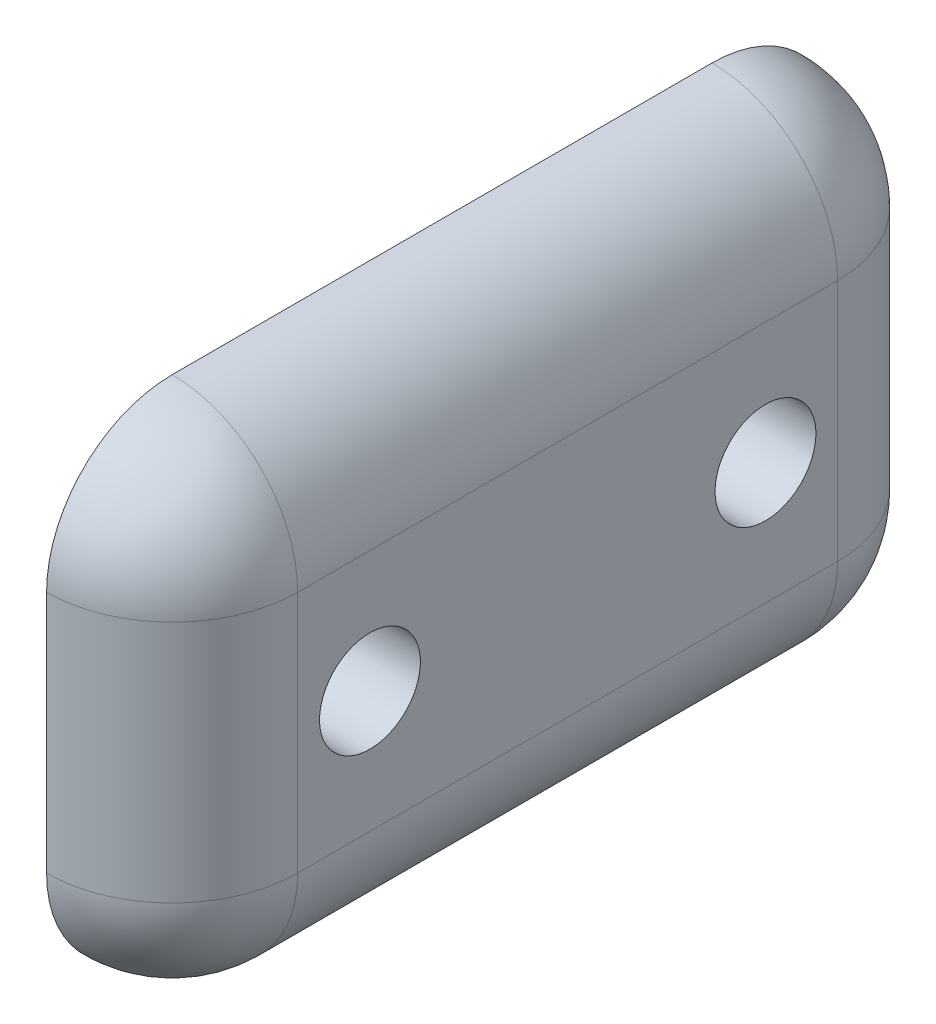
ISO-10303-21;
HEADER;
FILE_DESCRIPTION(('STEP AP214'),'2;1');
FILE_NAME('part.step','',(''),(''),'','','');
FILE_SCHEMA(('AUTOMOTIVE_DESIGN { 1 0 10303 214 1 1 1 1 }'));
ENDSEC;
DATA;
#1=APPLICATION_CONTEXT('core data for automotive mechanical design processes');
#2=APPLICATION_PROTOCOL_DEFINITION('international standard','automotive_design',2000,#1);
#3=PRODUCT_CONTEXT('',#1,'mechanical');
#4=PRODUCT('Part','Part','',(#3));
#5=PRODUCT_RELATED_PRODUCT_CATEGORY('part','',(#4));
#6=PRODUCT_DEFINITION_FORMATION('','',#4);
#7=PRODUCT_DEFINITION_CONTEXT('part definition',#1,'design');
#8=PRODUCT_DEFINITION('design','',#6,#7);
#9=PRODUCT_DEFINITION_SHAPE('','',#8);
#10=(LENGTH_UNIT() NAMED_UNIT(*) SI_UNIT(.MILLI.,.METRE.));
#11=(NAMED_UNIT(*) PLANE_ANGLE_UNIT() SI_UNIT($,.RADIAN.));
#12=(NAMED_UNIT(*) SI_UNIT($,.STERADIAN.) SOLID_ANGLE_UNIT());
#13=UNCERTAINTY_MEASURE_WITH_UNIT(LENGTH_MEASURE(1.E-05),#10,'distance_accuracy_value','');
#14=(GEOMETRIC_REPRESENTATION_CONTEXT(3) GLOBAL_UNCERTAINTY_ASSIGNED_CONTEXT((#13)) GLOBAL_UNIT_ASSIGNED_CONTEXT((#10,
#11,#12)) REPRESENTATION_CONTEXT('',''));
#15=CARTESIAN_POINT('',(0.,0.,0.));
#16=DIRECTION('',(0.,0.,1.));
#17=DIRECTION('',(1.,0.,0.));
#18=AXIS2_PLACEMENT_3D('',#15,#16,#17);
#19=CARTESIAN_POINT('',(3.175,-12.5,20.));
#20=DIRECTION('',(1.,0.,0.));
#21=DIRECTION('',(0.,0.,-1.));
#22=AXIS2_PLACEMENT_3D('',#19,#20,#21);
#23=PLANE('',#22);
#24=CARTESIAN_POINT('',(3.175,0.,10.));
#25=DIRECTION('',(-1.,0.,0.));
#26=DIRECTION('',(0.,0.,1.));
#27=AXIS2_PLACEMENT_3D('',#24,#25,#26);
#28=CIRCLE('',#27,2.55);
#29=CARTESIAN_POINT('',(3.175,0.,12.55));
#30=VERTEX_POINT('',#29);
#31=EDGE_CURVE('E149',#30,#30,#28,.T.);
#32=ORIENTED_EDGE('',*,*,#31,.T.);
#33=EDGE_LOOP('',(#32));
#34=FACE_BOUND('',#33,.T.);
#35=CARTESIAN_POINT('',(3.175,0.,-10.));
#36=DIRECTION('',(-1.,0.,0.));
#37=DIRECTION('',(0.,0.,1.));
#38=AXIS2_PLACEMENT_3D('',#35,#36,#37);
#39=CIRCLE('',#38,2.55);
#40=CARTESIAN_POINT('',(3.175,0.,-7.45));
#41=VERTEX_POINT('',#40);
#42=EDGE_CURVE('E108',#41,#41,#39,.T.);
#43=ORIENTED_EDGE('',*,*,#42,.T.);
#44=EDGE_LOOP('',(#43));
#45=FACE_BOUND('',#44,.T.);
#46=DIRECTION('',(0.,1.,0.));
#47=VECTOR('',#46,1.);
#48=CARTESIAN_POINT('',(3.175,12.5,-13.65));
#49=LINE('',#48,#47);
#50=CARTESIAN_POINT('',(3.175,-6.15,-13.65));
#51=VERTEX_POINT('',#50);
#52=CARTESIAN_POINT('',(3.175,6.15,-13.65));
#53=VERTEX_POINT('',#52);
#54=EDGE_CURVE('E45',#51,#53,#49,.T.);
#55=ORIENTED_EDGE('',*,*,#54,.T.);
#56=DIRECTION('',(0.,0.,1.));
#57=VECTOR('',#56,1.);
#58=CARTESIAN_POINT('',(3.175,6.15,20.));
#59=LINE('',#58,#57);
#60=CARTESIAN_POINT('',(3.175,6.15,13.65));
#61=VERTEX_POINT('',#60);
#62=EDGE_CURVE('E11',#53,#61,#59,.T.);
#63=ORIENTED_EDGE('',*,*,#62,.T.);
#64=DIRECTION('',(0.,-1.,0.));
#65=VECTOR('',#64,1.);
#66=CARTESIAN_POINT('',(3.175,-12.5,13.65));
#67=LINE('',#66,#65);
#68=CARTESIAN_POINT('',(3.175,-6.15,13.65));
#69=VERTEX_POINT('',#68);
#70=EDGE_CURVE('E104',#61,#69,#67,.T.);
#71=ORIENTED_EDGE('',*,*,#70,.T.);
#72=DIRECTION('',(0.,0.,-1.));
#73=VECTOR('',#72,1.);
#74=CARTESIAN_POINT('',(3.175,-6.15,-20.));
#75=LINE('',#74,#73);
#76=EDGE_CURVE('E55',#69,#51,#75,.T.);
#77=ORIENTED_EDGE('',*,*,#76,.T.);
#78=EDGE_LOOP('',(#55,#63,#71,#77));
#79=FACE_BOUND('',#78,.T.);
#80=ADVANCED_FACE('F38',(#34,#45,#79),#23,.T.);
#81=CARTESIAN_POINT('',(-3.175,-12.5,20.));
#82=DIRECTION('',(1.,0.,0.));
#83=DIRECTION('',(0.,0.,-1.));
#84=AXIS2_PLACEMENT_3D('',#81,#82,#83);
#85=PLANE('',#84);
#86=CARTESIAN_POINT('',(-3.175,0.,10.));
#87=DIRECTION('',(-1.,0.,0.));
#88=DIRECTION('',(0.,0.,1.));
#89=AXIS2_PLACEMENT_3D('',#86,#87,#88);
#90=CIRCLE('',#89,2.54999999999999);
#91=CARTESIAN_POINT('',(-3.175,0.,12.55));
#92=VERTEX_POINT('',#91);
#93=EDGE_CURVE('E152',#92,#92,#90,.T.);
#94=ORIENTED_EDGE('',*,*,#93,.F.);
#95=EDGE_LOOP('',(#94));
#96=FACE_BOUND('',#95,.T.);
#97=CARTESIAN_POINT('',(-3.175,0.,-10.));
#98=DIRECTION('',(-1.,0.,0.));
#99=DIRECTION('',(0.,0.,1.));
#100=AXIS2_PLACEMENT_3D('',#97,#98,#99);
#101=CIRCLE('',#100,2.54999999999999);
#102=CARTESIAN_POINT('',(-3.175,0.,-7.45000000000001));
#103=VERTEX_POINT('',#102);
#104=EDGE_CURVE('E146',#103,#103,#101,.T.);
#105=ORIENTED_EDGE('',*,*,#104,.F.);
#106=EDGE_LOOP('',(#105));
#107=FACE_BOUND('',#106,.T.);
#108=DIRECTION('',(0.,-1.,0.));
#109=VECTOR('',#108,1.);
#110=CARTESIAN_POINT('',(-3.175,12.5,20.));
#111=LINE('',#110,#109);
#112=CARTESIAN_POINT('',(-3.175,6.15,20.));
#113=VERTEX_POINT('',#112);
#114=CARTESIAN_POINT('',(-3.175,-6.15,20.));
#115=VERTEX_POINT('',#114);
#116=EDGE_CURVE('E88',#113,#115,#111,.T.);
#117=ORIENTED_EDGE('',*,*,#116,.F.);
#118=CARTESIAN_POINT('',(-3.175,6.15,13.65));
#119=DIRECTION('',(1.,0.,0.));
#120=DIRECTION('',(0.,0.,-1.));
#121=AXIS2_PLACEMENT_3D('',#118,#119,#120);
#122=CIRCLE('',#121,6.35);
#123=CARTESIAN_POINT('',(-3.175,12.5,13.65));
#124=VERTEX_POINT('',#123);
#125=EDGE_CURVE('E92',#113,#124,#122,.F.);
#126=ORIENTED_EDGE('',*,*,#125,.T.);
#127=DIRECTION('',(0.,0.,1.));
#128=VECTOR('',#127,1.);
#129=CARTESIAN_POINT('',(-3.175,12.5,20.));
#130=LINE('',#129,#128);
#131=CARTESIAN_POINT('',(-3.175,12.5,-13.65));
#132=VERTEX_POINT('',#131);
#133=EDGE_CURVE('E121',#132,#124,#130,.T.);
#134=ORIENTED_EDGE('',*,*,#133,.F.);
#135=CARTESIAN_POINT('',(-3.175,6.15,-13.65));
#136=DIRECTION('',(1.,0.,0.));
#137=DIRECTION('',(0.,0.,-1.));
#138=AXIS2_PLACEMENT_3D('',#135,#136,#137);
#139=CIRCLE('',#138,6.35);
#140=CARTESIAN_POINT('',(-3.175,6.15,-20.));
#141=VERTEX_POINT('',#140);
#142=EDGE_CURVE('E112',#132,#141,#139,.F.);
#143=ORIENTED_EDGE('',*,*,#142,.T.);
#144=DIRECTION('',(0.,1.,0.));
#145=VECTOR('',#144,1.);
#146=CARTESIAN_POINT('',(-3.175,12.5,-20.));
#147=LINE('',#146,#145);
#148=CARTESIAN_POINT('',(-3.175,-6.14999999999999,-20.));
#149=VERTEX_POINT('',#148);
#150=EDGE_CURVE('E123',#149,#141,#147,.T.);
#151=ORIENTED_EDGE('',*,*,#150,.F.);
#152=CARTESIAN_POINT('',(-3.175,-6.15,-13.65));
#153=DIRECTION('',(1.,0.,0.));
#154=DIRECTION('',(0.,0.,-1.));
#155=AXIS2_PLACEMENT_3D('',#152,#153,#154);
#156=CIRCLE('',#155,6.35);
#157=CARTESIAN_POINT('',(-3.175,-12.5,-13.65));
#158=VERTEX_POINT('',#157);
#159=EDGE_CURVE('E115',#149,#158,#156,.F.);
#160=ORIENTED_EDGE('',*,*,#159,.T.);
#161=DIRECTION('',(0.,0.,-1.));
#162=VECTOR('',#161,1.);
#163=CARTESIAN_POINT('',(-3.175,-12.5,20.));
#164=LINE('',#163,#162);
#165=CARTESIAN_POINT('',(-3.175,-12.5,13.65));
#166=VERTEX_POINT('',#165);
#167=EDGE_CURVE('E98',#166,#158,#164,.T.);
#168=ORIENTED_EDGE('',*,*,#167,.F.);
#169=CARTESIAN_POINT('',(-3.175,-6.15,13.65));
#170=DIRECTION('',(1.,0.,0.));
#171=DIRECTION('',(0.,0.,-1.));
#172=AXIS2_PLACEMENT_3D('',#169,#170,#171);
#173=CIRCLE('',#172,6.35);
#174=EDGE_CURVE('E94',#166,#115,#173,.F.);
#175=ORIENTED_EDGE('',*,*,#174,.T.);
#176=EDGE_LOOP('',(#117,#126,#134,#143,#151,#160,#168,#175));
#177=FACE_BOUND('',#176,.T.);
#178=ADVANCED_FACE('F90',(#96,#107,#177),#85,.F.);
#179=CARTESIAN_POINT('',(-3.175,-6.15,-13.65));
#180=DIRECTION('',(0.,0.,1.));
#181=DIRECTION('',(1.,0.,0.));
#182=AXIS2_PLACEMENT_3D('',#179,#180,#181);
#183=SPHERICAL_SURFACE('',#182,6.35);
#184=CARTESIAN_POINT('',(-3.175,-6.15,-13.65));
#185=DIRECTION('',(0.,0.,-1.));
#186=DIRECTION('',(0.,1.,0.));
#187=AXIS2_PLACEMENT_3D('',#184,#185,#186);
#188=CIRCLE('',#187,6.35);
#189=EDGE_CURVE('E130',#158,#51,#188,.F.);
#190=ORIENTED_EDGE('',*,*,#189,.F.);
#191=ORIENTED_EDGE('',*,*,#159,.F.);
#192=CARTESIAN_POINT('',(-3.175,-6.15,-13.65));
#193=DIRECTION('',(0.,-1.,0.));
#194=DIRECTION('',(1.,0.,0.));
#195=AXIS2_PLACEMENT_3D('',#192,#193,#194);
#196=CIRCLE('',#195,6.35);
#197=EDGE_CURVE('E99',#51,#149,#196,.F.);
#198=ORIENTED_EDGE('',*,*,#197,.F.);
#199=EDGE_LOOP('',(#190,#191,#198));
#200=FACE_BOUND('',#199,.T.);
#201=ADVANCED_FACE('F160',(#200),#183,.T.);
#202=CARTESIAN_POINT('',(-3.175,-12.5,-13.65));
#203=DIRECTION('',(0.,-1.,0.));
#204=DIRECTION('',(0.,0.,-1.));
#205=AXIS2_PLACEMENT_3D('',#202,#203,#204);
#206=CYLINDRICAL_SURFACE('',#205,6.35);
#207=ORIENTED_EDGE('',*,*,#197,.T.);
#208=ORIENTED_EDGE('',*,*,#150,.T.);
#209=CARTESIAN_POINT('',(-3.175,6.15,-13.65));
#210=DIRECTION('',(0.,1.,0.));
#211=DIRECTION('',(0.,0.,1.));
#212=AXIS2_PLACEMENT_3D('',#209,#210,#211);
#213=CIRCLE('',#212,6.35);
#214=EDGE_CURVE('E132',#53,#141,#213,.T.);
#215=ORIENTED_EDGE('',*,*,#214,.F.);
#216=ORIENTED_EDGE('',*,*,#54,.F.);
#217=EDGE_LOOP('',(#207,#208,#215,#216));
#218=FACE_BOUND('',#217,.T.);
#219=ADVANCED_FACE('F192',(#218),#206,.T.);
#220=CARTESIAN_POINT('',(-3.175,-6.15,20.));
#221=DIRECTION('',(0.,0.,1.));
#222=DIRECTION('',(0.,-1.,0.));
#223=AXIS2_PLACEMENT_3D('',#220,#221,#222);
#224=CYLINDRICAL_SURFACE('',#223,6.35);
#225=ORIENTED_EDGE('',*,*,#189,.T.);
#226=ORIENTED_EDGE('',*,*,#76,.F.);
#227=CARTESIAN_POINT('',(-3.175,-6.15,13.65));
#228=DIRECTION('',(0.,0.,1.));
#229=DIRECTION('',(1.,0.,0.));
#230=AXIS2_PLACEMENT_3D('',#227,#228,#229);
#231=CIRCLE('',#230,6.35);
#232=EDGE_CURVE('E135',#166,#69,#231,.T.);
#233=ORIENTED_EDGE('',*,*,#232,.F.);
#234=ORIENTED_EDGE('',*,*,#167,.T.);
#235=EDGE_LOOP('',(#225,#226,#233,#234));
#236=FACE_BOUND('',#235,.T.);
#237=ADVANCED_FACE('F200',(#236),#224,.T.);
#238=CARTESIAN_POINT('',(-3.175,6.15,-13.65));
#239=DIRECTION('',(0.,0.,1.));
#240=DIRECTION('',(1.,0.,0.));
#241=AXIS2_PLACEMENT_3D('',#238,#239,#240);
#242=SPHERICAL_SURFACE('',#241,6.35);
#243=ORIENTED_EDGE('',*,*,#214,.T.);
#244=ORIENTED_EDGE('',*,*,#142,.F.);
#245=CARTESIAN_POINT('',(-3.175,6.15,-13.65));
#246=DIRECTION('',(0.,0.,-1.));
#247=DIRECTION('',(-1.,0.,0.));
#248=AXIS2_PLACEMENT_3D('',#245,#246,#247);
#249=CIRCLE('',#248,6.35);
#250=EDGE_CURVE('E138',#53,#132,#249,.F.);
#251=ORIENTED_EDGE('',*,*,#250,.F.);
#252=EDGE_LOOP('',(#243,#244,#251));
#253=FACE_BOUND('',#252,.T.);
#254=ADVANCED_FACE('F208',(#253),#242,.T.);
#255=CARTESIAN_POINT('',(-3.175,-6.15,13.65));
#256=DIRECTION('',(0.,0.,1.));
#257=DIRECTION('',(1.,0.,0.));
#258=AXIS2_PLACEMENT_3D('',#255,#256,#257);
#259=SPHERICAL_SURFACE('',#258,6.35);
#260=ORIENTED_EDGE('',*,*,#174,.F.);
#261=ORIENTED_EDGE('',*,*,#232,.T.);
#262=CARTESIAN_POINT('',(-3.175,-6.15,13.65));
#263=DIRECTION('',(0.,-1.,0.));
#264=DIRECTION('',(0.,0.,-1.));
#265=AXIS2_PLACEMENT_3D('',#262,#263,#264);
#266=CIRCLE('',#265,6.35);
#267=EDGE_CURVE('E141',#115,#69,#266,.F.);
#268=ORIENTED_EDGE('',*,*,#267,.F.);
#269=EDGE_LOOP('',(#260,#261,#268));
#270=FACE_BOUND('',#269,.T.);
#271=ADVANCED_FACE('F216',(#270),#259,.T.);
#272=CARTESIAN_POINT('',(-3.175,6.15,20.));
#273=DIRECTION('',(0.,0.,-1.));
#274=DIRECTION('',(0.,1.,0.));
#275=AXIS2_PLACEMENT_3D('',#272,#273,#274);
#276=CYLINDRICAL_SURFACE('',#275,6.35);
#277=ORIENTED_EDGE('',*,*,#250,.T.);
#278=ORIENTED_EDGE('',*,*,#133,.T.);
#279=CARTESIAN_POINT('',(-3.175,6.15,13.65));
#280=DIRECTION('',(0.,0.,1.));
#281=DIRECTION('',(1.,0.,0.));
#282=AXIS2_PLACEMENT_3D('',#279,#280,#281);
#283=CIRCLE('',#282,6.35);
#284=EDGE_CURVE('E107',#61,#124,#283,.T.);
#285=ORIENTED_EDGE('',*,*,#284,.F.);
#286=ORIENTED_EDGE('',*,*,#62,.F.);
#287=EDGE_LOOP('',(#277,#278,#285,#286));
#288=FACE_BOUND('',#287,.T.);
#289=ADVANCED_FACE('F224',(#288),#276,.T.);
#290=CARTESIAN_POINT('',(-3.175,-12.5,13.65));
#291=DIRECTION('',(0.,1.,0.));
#292=DIRECTION('',(0.,0.,1.));
#293=AXIS2_PLACEMENT_3D('',#290,#291,#292);
#294=CYLINDRICAL_SURFACE('',#293,6.35);
#295=ORIENTED_EDGE('',*,*,#267,.T.);
#296=ORIENTED_EDGE('',*,*,#70,.F.);
#297=CARTESIAN_POINT('',(-3.175,6.15,13.65));
#298=DIRECTION('',(0.,1.,0.));
#299=DIRECTION('',(-1.,0.,0.));
#300=AXIS2_PLACEMENT_3D('',#297,#298,#299);
#301=CIRCLE('',#300,6.35);
#302=EDGE_CURVE('E102',#113,#61,#301,.T.);
#303=ORIENTED_EDGE('',*,*,#302,.F.);
#304=ORIENTED_EDGE('',*,*,#116,.T.);
#305=EDGE_LOOP('',(#295,#296,#303,#304));
#306=FACE_BOUND('',#305,.T.);
#307=ADVANCED_FACE('F103',(#306),#294,.T.);
#308=CARTESIAN_POINT('',(-3.175,6.15,13.65));
#309=DIRECTION('',(0.,0.,1.));
#310=DIRECTION('',(1.,0.,0.));
#311=AXIS2_PLACEMENT_3D('',#308,#309,#310);
#312=SPHERICAL_SURFACE('',#311,6.35);
#313=ORIENTED_EDGE('',*,*,#125,.F.);
#314=ORIENTED_EDGE('',*,*,#302,.T.);
#315=ORIENTED_EDGE('',*,*,#284,.T.);
#316=EDGE_LOOP('',(#313,#314,#315));
#317=FACE_BOUND('',#316,.T.);
#318=ADVANCED_FACE('F110',(#317),#312,.T.);
#319=CARTESIAN_POINT('',(-3.175,0.,-10.));
#320=DIRECTION('',(-1.,0.,0.));
#321=DIRECTION('',(0.,0.,1.));
#322=AXIS2_PLACEMENT_3D('',#319,#320,#321);
#323=CYLINDRICAL_SURFACE('',#322,2.54999999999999);
#324=ORIENTED_EDGE('',*,*,#42,.F.);
#325=EDGE_LOOP('',(#324));
#326=FACE_BOUND('',#325,.T.);
#327=ORIENTED_EDGE('',*,*,#104,.T.);
#328=EDGE_LOOP('',(#327));
#329=FACE_BOUND('',#328,.T.);
#330=ADVANCED_FACE('F163',(#326,#329),#323,.F.);
#331=CARTESIAN_POINT('',(-3.175,0.,10.));
#332=DIRECTION('',(-1.,0.,0.));
#333=DIRECTION('',(0.,0.,1.));
#334=AXIS2_PLACEMENT_3D('',#331,#332,#333);
#335=CYLINDRICAL_SURFACE('',#334,2.54999999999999);
#336=ORIENTED_EDGE('',*,*,#31,.F.);
#337=EDGE_LOOP('',(#336));
#338=FACE_BOUND('',#337,.T.);
#339=ORIENTED_EDGE('',*,*,#93,.T.);
#340=EDGE_LOOP('',(#339));
#341=FACE_BOUND('',#340,.T.);
#342=ADVANCED_FACE('F156',(#338,#341),#335,.F.);
#343=CLOSED_SHELL('',(#80,#178,#201,#219,#237,#254,#271,#289,#307,#318,#330,#342));
#344=MANIFOLD_SOLID_BREP('B2',#343);
#345=ADVANCED_BREP_SHAPE_REPRESENTATION('',(#18,#344),#14);
#346=SHAPE_DEFINITION_REPRESENTATION(#9,#345);
ENDSEC;
END-ISO-10303-21;
